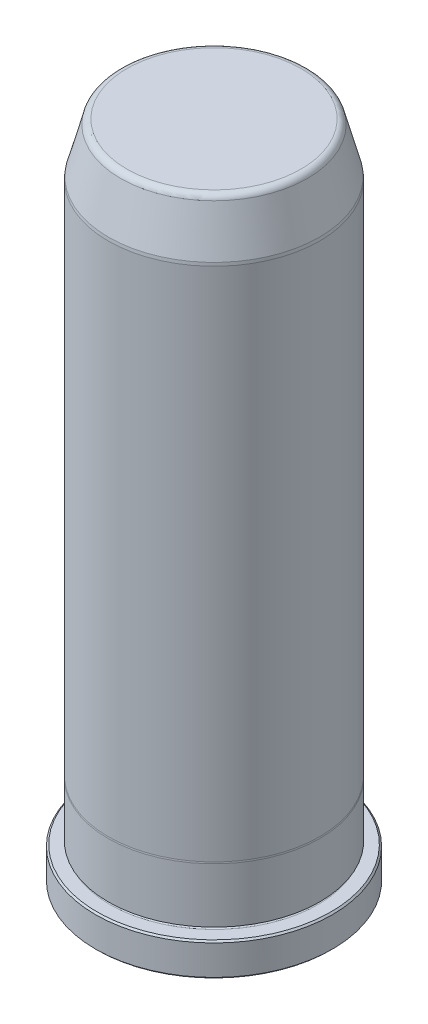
from build123d import *

# Parameters (mm, degrees)
FILLET6_R     = 1.5875
CHAMFER1_SIZE = 0.381


with BuildPart() as part:
    # Sketch1 → Revolve1 (revolve)
    with BuildSketch(Plane(origin=(0, 0, 0), x_dir=(0, 0, -1), z_dir=(1, 0, 0)), mode=Mode.PRIVATE) as revolve1_sk:
        with BuildLine():
            Line((0, 0), (28.448, 0))
            Line((28.448, 0), (28.448, 7.9248))
            Line((28.448, 7.9248), (25.0063, 7.9248))
            ThreePointArc((25.0063, 7.9248), (24.6253, 8.3058), (25.0063, 8.6868))
            Line((25.0063, 8.6868), (25.4127, 8.6868))
            Line((25.4127, 8.6868), (25.4127, 21.861763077))
            Line((25.4127, 21.861763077), (25.3873, 22.225))
            Line((25.3873, 22.225), (25.3873, 146.05))
            Line((25.3873, 146.05), (25.320633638, 146.812))
            Line((25.320633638, 146.812), (22.121856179, 158.75))
            Line((22.121856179, 158.75), (0, 158.75))
            Line((0, 158.75), (0, 0))
        make_face()
    revolve(revolve1_sk.sketch.rotate(Axis((0, 0, 0), (0, -1, 0)), 180), axis=Axis((0, 0, 0), (0, -1, 0)))

    # Fillet6
    fillet6_edges = [part.edges().sort_by_distance(p)[0] for p in [
        (0, 158.75, -22.121856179),
    ]]
    fillet(fillet6_edges, radius=FILLET6_R)

    # Chamfer1
    chamfer1_edges = [part.edges().sort_by_distance(p)[0] for p in [
        (0, 7.9248, -28.448),
        (0, 0, -28.448),
    ]]
    chamfer(chamfer1_edges, length=CHAMFER1_SIZE)


solid = part.part
